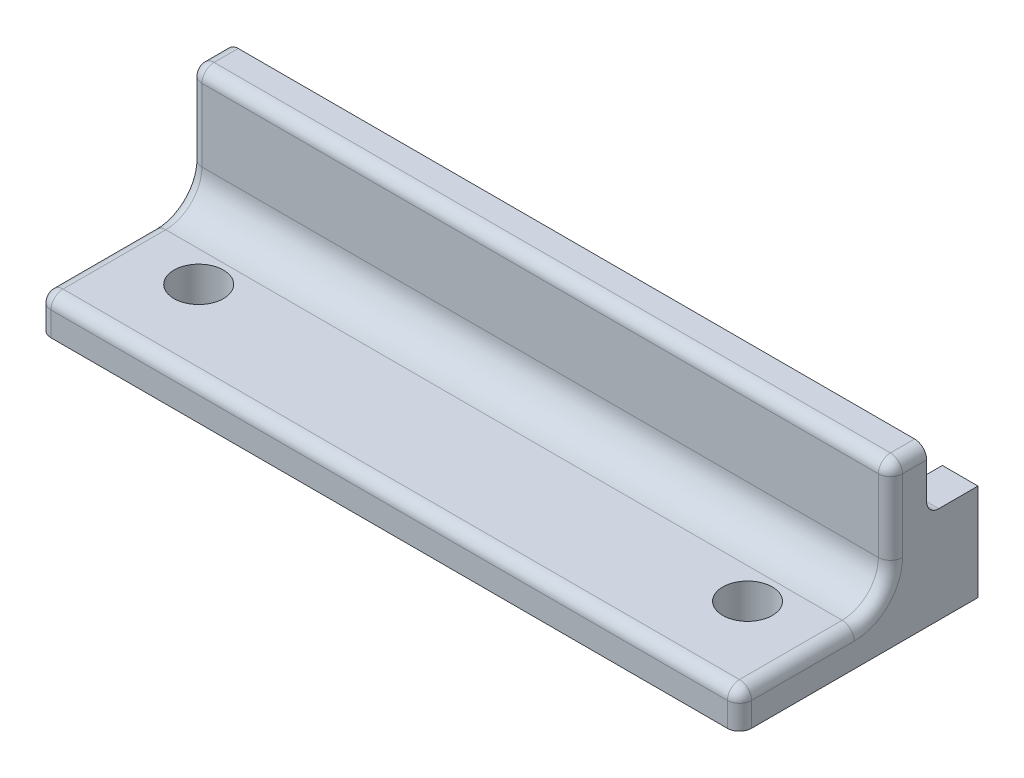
from build123d import *

# Parameters (mm, degrees)
ESQUISSE1_W        = 58
ESQUISSE1_H        = 10
BOSS_EXTRU_1_DEPTH = 3
ESQUISSE4_W        = 58
ESQUISSE4_H        = 15.5
ESQUISSE4_R        = 2.05
BOSS_EXTRU_2_DEPTH = 3
CONG_3_R           = 3
CONG_4_R           = 1
CONG_5_R           = 1
CONG_6_R           = 1
CONG_7_R           = 1
ESQUISSE6_R        = 1.2
BOSS_EXTRU_3_DEPTH = 3
ESQUISSE7_W        = 2.95
ESQUISSE7_H        = 4.25
BOSS_EXTRU_4_DEPTH = 8
CONG_8_R           = 1
CONG_9_R           = 1


with BuildPart() as part:
    # Esquisse1 → Boss.-Extru.1 (new body)
    with BuildSketch(Plane.XY):
        with Locations((17.40035222, 1.659309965)):
            Rectangle(ESQUISSE1_W, ESQUISSE1_H)
    extrude(amount=BOSS_EXTRU_1_DEPTH)

    # Esquisse4 → Boss.-Extru.2 (add)
    with BuildSketch(Plane.XZ.offset(3.340690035)):
        with Locations((17.40035222, 7.75)):
            Rectangle(ESQUISSE4_W, ESQUISSE4_H)
        with Locations((40.12035222, 8.548954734)):
            Circle(ESQUISSE4_R, mode=Mode.SUBTRACT)
        with Locations((-5.31964778, 8.548954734)):
            Circle(ESQUISSE4_R, mode=Mode.SUBTRACT)
    extrude(amount=BOSS_EXTRU_2_DEPTH)

    # Cong_3
    cong_3_edges = [part.edges().sort_by_distance(p)[0] for p in [
        (17.40035222, -3.340690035, 3),
    ]]
    fillet(cong_3_edges, radius=CONG_3_R)

    # Cong_4
    cong_4_edges = [part.edges().sort_by_distance(p)[0] for p in [
        (17.40035222, -3.340690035, 15.5),
    ]]
    fillet(cong_4_edges, radius=CONG_4_R)

    # Cong_5
    cong_5_edges = [part.edges().sort_by_distance(p)[0] for p in [
        (17.40035222, 6.659309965, 3),
    ]]
    fillet(cong_5_edges, radius=CONG_5_R)

    # Cong_6
    cong_6_edges = [part.edges().sort_by_distance(p)[0] for p in [
        (-11.59964778, -5.340690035, 15.5),
        (-11.59964778, -2.462010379, 3.878679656),
        (-11.59964778, -3.340690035, 10.25),
        (-11.59964778, -3.633583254, 15.207106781),
        (-11.59964778, 2.659309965, 3),
        (-11.59964778, 6.659309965, 1),
        (-11.59964778, 6.366416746, 2.707106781),
    ]]
    fillet(cong_6_edges, radius=CONG_6_R)

    # Cong_7
    cong_7_edges = [part.edges().sort_by_distance(p)[0] for p in [
        (46.40035222, -5.340690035, 15.5),
        (46.40035222, -3.340690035, 10.25),
        (46.40035222, -2.462010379, 3.878679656),
        (46.40035222, -3.633583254, 15.207106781),
        (46.40035222, 2.659309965, 3),
        (46.40035222, 6.659309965, 1),
        (46.40035222, 6.366416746, 2.707106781),
    ]]
    fillet(cong_7_edges, radius=CONG_7_R)

    # Esquisse6 → Boss.-Extru.3 (add)
    with BuildSketch(Plane(origin=(0, 0, 0), x_dir=(-1, 0, 0), z_dir=(0, 0, -1))):
        with Locations(Location((-38.50035222, 1.659309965, 0), (0, 0, 180))):
            Circle(ESQUISSE6_R)
        with Locations(Location((3.69964778, 1.659309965, 0), (0, 0, 180))):
            Circle(ESQUISSE6_R)
    extrude(amount=BOSS_EXTRU_3_DEPTH)

    # Esquisse7 → Boss.-Extru.4 (add)
    with BuildSketch(Plane(origin=(46.40035222, -6.340690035, 0), x_dir=(1, 0, 0), z_dir=(0, -1, 0))):
        with Locations((-56.525, -2.125)):
            Rectangle(ESQUISSE7_W, ESQUISSE7_H)
        with Locations((-1.475, -2.125)):
            Rectangle(ESQUISSE7_W, ESQUISSE7_H)
    extrude(amount=-BOSS_EXTRU_4_DEPTH)

    # Cong_8
    cong_8_edges = [part.edges().sort_by_distance(p)[0] for p in [
        (-10.12464778, 1.659309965, 0),
    ]]
    fillet(cong_8_edges, radius=CONG_8_R)

    # Cong_9
    cong_9_edges = [part.edges().sort_by_distance(p)[0] for p in [
        (44.92535222, 1.659309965, 0),
    ]]
    fillet(cong_9_edges, radius=CONG_9_R)


solid = part.part
